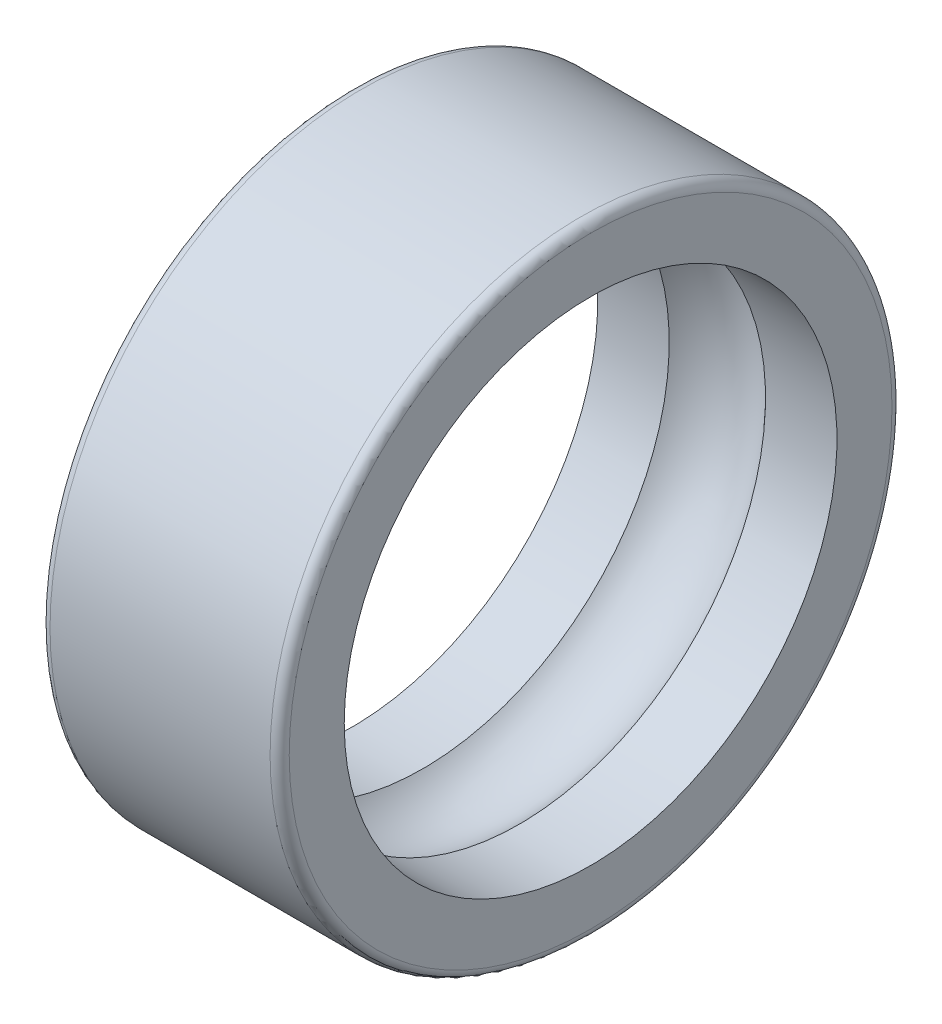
ISO-10303-21;
HEADER;
FILE_DESCRIPTION(('STEP AP214'),'2;1');
FILE_NAME('part.step','',(''),(''),'','','');
FILE_SCHEMA(('AUTOMOTIVE_DESIGN { 1 0 10303 214 1 1 1 1 }'));
ENDSEC;
DATA;
#1=APPLICATION_CONTEXT('core data for automotive mechanical design processes');
#2=APPLICATION_PROTOCOL_DEFINITION('international standard','automotive_design',2000,#1);
#3=PRODUCT_CONTEXT('',#1,'mechanical');
#4=PRODUCT('Part','Part','',(#3));
#5=PRODUCT_RELATED_PRODUCT_CATEGORY('part','',(#4));
#6=PRODUCT_DEFINITION_FORMATION('','',#4);
#7=PRODUCT_DEFINITION_CONTEXT('part definition',#1,'design');
#8=PRODUCT_DEFINITION('design','',#6,#7);
#9=PRODUCT_DEFINITION_SHAPE('','',#8);
#10=(LENGTH_UNIT() NAMED_UNIT(*) SI_UNIT(.MILLI.,.METRE.));
#11=(NAMED_UNIT(*) PLANE_ANGLE_UNIT() SI_UNIT($,.RADIAN.));
#12=(NAMED_UNIT(*) SI_UNIT($,.STERADIAN.) SOLID_ANGLE_UNIT());
#13=UNCERTAINTY_MEASURE_WITH_UNIT(LENGTH_MEASURE(1.E-05),#10,'distance_accuracy_value','');
#14=(GEOMETRIC_REPRESENTATION_CONTEXT(3) GLOBAL_UNCERTAINTY_ASSIGNED_CONTEXT((#13)) GLOBAL_UNIT_ASSIGNED_CONTEXT((#10,
#11,#12)) REPRESENTATION_CONTEXT('',''));
#15=CARTESIAN_POINT('',(0.,0.,0.));
#16=DIRECTION('',(0.,0.,1.));
#17=DIRECTION('',(1.,0.,0.));
#18=AXIS2_PLACEMENT_3D('',#15,#16,#17);
#19=CARTESIAN_POINT('',(0.200000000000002,0.,0.));
#20=DIRECTION('',(-0.999999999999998,0.,0.));
#21=DIRECTION('',(0.,0.,1.));
#22=AXIS2_PLACEMENT_3D('',#19,#20,#21);
#23=TOROIDAL_SURFACE('',#22,6.3,0.2);
#24=CARTESIAN_POINT('',(0.,0.,0.));
#25=DIRECTION('',(-0.999999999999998,0.,0.));
#26=DIRECTION('',(0.,0.,1.));
#27=AXIS2_PLACEMENT_3D('',#24,#25,#26);
#28=CIRCLE('',#27,6.3);
#29=CARTESIAN_POINT('',(0.,0.,6.30000000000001));
#30=VERTEX_POINT('',#29);
#31=EDGE_CURVE('E10',#30,#30,#28,.T.);
#32=ORIENTED_EDGE('',*,*,#31,.F.);
#33=EDGE_LOOP('',(#32));
#34=FACE_BOUND('',#33,.T.);
#35=CARTESIAN_POINT('',(0.200000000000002,0.,0.));
#36=DIRECTION('',(-0.999999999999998,0.,0.));
#37=DIRECTION('',(0.,0.,1.));
#38=AXIS2_PLACEMENT_3D('',#35,#36,#37);
#39=CIRCLE('',#38,6.5);
#40=CARTESIAN_POINT('',(0.200000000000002,0.,6.50000000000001));
#41=VERTEX_POINT('',#40);
#42=EDGE_CURVE('E52',#41,#41,#39,.T.);
#43=ORIENTED_EDGE('',*,*,#42,.T.);
#44=EDGE_LOOP('',(#43));
#45=FACE_BOUND('',#44,.T.);
#46=ADVANCED_FACE('F24',(#34,#45),#23,.T.);
#47=CARTESIAN_POINT('',(0.,0.,-6.30000000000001));
#48=DIRECTION('',(0.999999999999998,0.,0.));
#49=DIRECTION('',(0.,0.,-1.));
#50=AXIS2_PLACEMENT_3D('',#47,#48,#49);
#51=PLANE('',#50);
#52=CARTESIAN_POINT('',(0.,0.,0.));
#53=DIRECTION('',(-0.999999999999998,0.,0.));
#54=DIRECTION('',(0.,0.,1.));
#55=AXIS2_PLACEMENT_3D('',#52,#53,#54);
#56=CIRCLE('',#55,5.15);
#57=CARTESIAN_POINT('',(0.,0.,5.15000000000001));
#58=VERTEX_POINT('',#57);
#59=EDGE_CURVE('E30',#58,#58,#56,.T.);
#60=ORIENTED_EDGE('',*,*,#59,.F.);
#61=EDGE_LOOP('',(#60));
#62=FACE_BOUND('',#61,.T.);
#63=ORIENTED_EDGE('',*,*,#31,.T.);
#64=EDGE_LOOP('',(#63));
#65=FACE_BOUND('',#64,.T.);
#66=ADVANCED_FACE('F89',(#62,#65),#51,.F.);
#67=CARTESIAN_POINT('',(0.,0.,0.));
#68=DIRECTION('',(-0.999999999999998,0.,0.));
#69=DIRECTION('',(0.,0.,1.));
#70=AXIS2_PLACEMENT_3D('',#67,#68,#69);
#71=CYLINDRICAL_SURFACE('',#70,5.15);
#72=CARTESIAN_POINT('',(1.4937694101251,0.,0.));
#73=DIRECTION('',(-0.999999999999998,0.,0.));
#74=DIRECTION('',(0.,0.,1.));
#75=AXIS2_PLACEMENT_3D('',#72,#73,#74);
#76=CIRCLE('',#75,5.15);
#77=CARTESIAN_POINT('',(1.4937694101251,0.,5.15000000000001));
#78=VERTEX_POINT('',#77);
#79=EDGE_CURVE('E34',#78,#78,#76,.T.);
#80=CARTESIAN_POINT('',(1.4937694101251,0.,5.15000000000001));
#81=CARTESIAN_POINT('',(1.47820931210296,0.,5.15000000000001));
#82=CARTESIAN_POINT('',(1.46264921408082,0.,5.15000000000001));
#83=CARTESIAN_POINT('',(1.43152901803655,0.,5.15000000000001));
#84=CARTESIAN_POINT('',(1.41596892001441,0.,5.15000000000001));
#85=CARTESIAN_POINT('',(1.38484872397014,0.,5.15000000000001));
#86=CARTESIAN_POINT('',(1.36928862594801,0.,5.15000000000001));
#87=CARTESIAN_POINT('',(1.33816842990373,0.,5.15000000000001));
#88=CARTESIAN_POINT('',(1.3226083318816,0.,5.15000000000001));
#89=CARTESIAN_POINT('',(1.29148813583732,0.,5.15000000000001));
#90=CARTESIAN_POINT('',(1.27592803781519,0.,5.15000000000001));
#91=CARTESIAN_POINT('',(1.24480784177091,0.,5.15000000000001));
#92=CARTESIAN_POINT('',(1.22924774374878,0.,5.15000000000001));
#93=CARTESIAN_POINT('',(1.19812754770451,0.,5.15000000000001));
#94=CARTESIAN_POINT('',(1.18256744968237,0.,5.15000000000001));
#95=CARTESIAN_POINT('',(1.1514472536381,0.,5.15000000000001));
#96=CARTESIAN_POINT('',(1.13588715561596,0.,5.15000000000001));
#97=CARTESIAN_POINT('',(1.10476695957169,0.,5.15000000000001));
#98=CARTESIAN_POINT('',(1.08920686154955,0.,5.15000000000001));
#99=CARTESIAN_POINT('',(1.05808666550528,0.,5.15000000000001));
#100=CARTESIAN_POINT('',(1.04252656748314,0.,5.15000000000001));
#101=CARTESIAN_POINT('',(1.01140637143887,0.,5.15000000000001));
#102=CARTESIAN_POINT('',(0.995846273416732,0.,5.15000000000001));
#103=CARTESIAN_POINT('',(0.964726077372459,0.,5.15000000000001));
#104=CARTESIAN_POINT('',(0.949165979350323,0.,5.15000000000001));
#105=CARTESIAN_POINT('',(0.91804578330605,0.,5.15000000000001));
#106=CARTESIAN_POINT('',(0.902485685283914,0.,5.15000000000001));
#107=CARTESIAN_POINT('',(0.871365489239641,0.,5.15000000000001));
#108=CARTESIAN_POINT('',(0.855805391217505,0.,5.15000000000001));
#109=CARTESIAN_POINT('',(0.824685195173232,0.,5.15000000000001));
#110=CARTESIAN_POINT('',(0.809125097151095,0.,5.15000000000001));
#111=CARTESIAN_POINT('',(0.778004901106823,0.,5.15000000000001));
#112=CARTESIAN_POINT('',(0.762444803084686,0.,5.15000000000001));
#113=CARTESIAN_POINT('',(0.731324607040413,0.,5.15000000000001));
#114=CARTESIAN_POINT('',(0.715764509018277,0.,5.15000000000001));
#115=CARTESIAN_POINT('',(0.684644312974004,0.,5.15000000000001));
#116=CARTESIAN_POINT('',(0.669084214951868,0.,5.15000000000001));
#117=CARTESIAN_POINT('',(0.637964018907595,0.,5.15000000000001));
#118=CARTESIAN_POINT('',(0.622403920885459,0.,5.15000000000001));
#119=CARTESIAN_POINT('',(0.591283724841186,0.,5.15000000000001));
#120=CARTESIAN_POINT('',(0.57572362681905,0.,5.15000000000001));
#121=CARTESIAN_POINT('',(0.544603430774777,0.,5.15000000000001));
#122=CARTESIAN_POINT('',(0.52904333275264,0.,5.15000000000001));
#123=CARTESIAN_POINT('',(0.497923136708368,0.,5.15000000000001));
#124=CARTESIAN_POINT('',(0.482363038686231,0.,5.15000000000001));
#125=CARTESIAN_POINT('',(0.451242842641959,0.,5.15000000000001));
#126=CARTESIAN_POINT('',(0.435682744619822,0.,5.15000000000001));
#127=CARTESIAN_POINT('',(0.404562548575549,0.,5.15000000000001));
#128=CARTESIAN_POINT('',(0.389002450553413,0.,5.15000000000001));
#129=CARTESIAN_POINT('',(0.35788225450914,0.,5.15000000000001));
#130=CARTESIAN_POINT('',(0.342322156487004,0.,5.15000000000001));
#131=CARTESIAN_POINT('',(0.311201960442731,0.,5.15000000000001));
#132=CARTESIAN_POINT('',(0.295641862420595,0.,5.15000000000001));
#133=CARTESIAN_POINT('',(0.264521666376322,0.,5.15000000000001));
#134=CARTESIAN_POINT('',(0.248961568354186,0.,5.15000000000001));
#135=CARTESIAN_POINT('',(0.217841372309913,0.,5.15000000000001));
#136=CARTESIAN_POINT('',(0.202281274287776,0.,5.15000000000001));
#137=CARTESIAN_POINT('',(0.171161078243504,0.,5.15000000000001));
#138=CARTESIAN_POINT('',(0.155600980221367,0.,5.15000000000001));
#139=CARTESIAN_POINT('',(0.124480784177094,0.,5.15000000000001));
#140=CARTESIAN_POINT('',(0.108920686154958,0.,5.15000000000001));
#141=CARTESIAN_POINT('',(0.0778004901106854,0.,5.15000000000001));
#142=CARTESIAN_POINT('',(0.0622403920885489,0.,5.15000000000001));
#143=CARTESIAN_POINT('',(0.0311201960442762,0.,5.15000000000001));
#144=CARTESIAN_POINT('',(0.0155600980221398,0.,5.15000000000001));
#145=CARTESIAN_POINT('',(0.,0.,5.15000000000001));
#146=B_SPLINE_CURVE_WITH_KNOTS('',3,(#80,#81,#82,#83,#84,#85,#86,#87,#88,#89,#90,#91,#92,#93,
#94,#95,#96,#97,#98,#99,#100,#101,#102,#103,#104,#105,#106,#107,#108,#109,#110,#111,#112,#113,
#114,#115,#116,#117,#118,#119,#120,#121,#122,#123,#124,#125,#126,#127,#128,#129,#130,#131,#132,
#133,#134,#135,#136,#137,#138,#139,#140,#141,#142,#143,#144,#145),.UNSPECIFIED.,.F.,.F.,(4,2,2,
2,2,2,2,2,2,2,2,2,2,2,2,2,2,2,2,2,2,2,2,2,2,2,2,2,2,2,2,2,4),(0.,0.0466802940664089,
0.0933605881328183,0.140040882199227,0.186721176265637,0.233401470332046,0.280081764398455,
0.326762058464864,0.373442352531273,0.420122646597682,0.466802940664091,0.513483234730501,
0.56016352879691,0.606843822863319,0.653524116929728,0.700204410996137,0.746884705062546,
0.793564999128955,0.840245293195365,0.886925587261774,0.933605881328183,0.980286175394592,
1.026966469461,1.07364676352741,1.12032705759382,1.16700735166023,1.21368764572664,
1.26036793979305,1.30704823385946,1.35372852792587,1.40040882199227,1.44708911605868,
1.49376941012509),.UNSPECIFIED.);
#147=EDGE_CURVE('BSEAM84',#78,#58,#146,.T.);
#148=ORIENTED_EDGE('',*,*,#79,.F.);
#149=ORIENTED_EDGE('',*,*,#59,.T.);
#150=ORIENTED_EDGE('',*,*,#147,.T.);
#151=ORIENTED_EDGE('',*,*,#147,.F.);
#152=EDGE_LOOP('',(#148,#150,#149,#151));
#153=FACE_BOUND('',#152,.T.);
#154=ADVANCED_FACE('F84',(#153),#71,.F.);
#155=CARTESIAN_POINT('',(2.5,0.,0.));
#156=DIRECTION('',(-0.999999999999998,0.,0.));
#157=DIRECTION('',(0.,0.,1.));
#158=AXIS2_PLACEMENT_3D('',#155,#156,#157);
#159=TOROIDAL_SURFACE('',#158,4.25,1.35);
#160=CARTESIAN_POINT('',(3.50623058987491,0.,0.));
#161=DIRECTION('',(-0.999999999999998,0.,0.));
#162=DIRECTION('',(0.,0.,1.));
#163=AXIS2_PLACEMENT_3D('',#160,#161,#162);
#164=CIRCLE('',#163,5.15);
#165=CARTESIAN_POINT('',(3.50623058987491,0.,5.15000000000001));
#166=VERTEX_POINT('',#165);
#167=EDGE_CURVE('E38',#166,#166,#164,.T.);
#168=ORIENTED_EDGE('',*,*,#167,.F.);
#169=EDGE_LOOP('',(#168));
#170=FACE_BOUND('',#169,.T.);
#171=ORIENTED_EDGE('',*,*,#79,.T.);
#172=EDGE_LOOP('',(#171));
#173=FACE_BOUND('',#172,.T.);
#174=ADVANCED_FACE('F78',(#170,#173),#159,.F.);
#175=CARTESIAN_POINT('',(0.,0.,0.));
#176=DIRECTION('',(-0.999999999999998,0.,0.));
#177=DIRECTION('',(0.,0.,1.));
#178=AXIS2_PLACEMENT_3D('',#175,#176,#177);
#179=CYLINDRICAL_SURFACE('',#178,5.15);
#180=CARTESIAN_POINT('',(5.,0.,0.));
#181=DIRECTION('',(-0.999999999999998,0.,0.));
#182=DIRECTION('',(0.,0.,1.));
#183=AXIS2_PLACEMENT_3D('',#180,#181,#182);
#184=CIRCLE('',#183,5.15);
#185=CARTESIAN_POINT('',(5.,0.,5.15000000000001));
#186=VERTEX_POINT('',#185);
#187=EDGE_CURVE('E43',#186,#186,#184,.T.);
#188=CARTESIAN_POINT('',(5.,0.,5.15000000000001));
#189=CARTESIAN_POINT('',(4.98443990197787,0.,5.15000000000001));
#190=CARTESIAN_POINT('',(4.96887980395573,0.,5.15000000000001));
#191=CARTESIAN_POINT('',(4.93775960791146,0.,5.15000000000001));
#192=CARTESIAN_POINT('',(4.92219950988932,0.,5.15000000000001));
#193=CARTESIAN_POINT('',(4.89107931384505,0.,5.15000000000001));
#194=CARTESIAN_POINT('',(4.87551921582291,0.,5.15000000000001));
#195=CARTESIAN_POINT('',(4.84439901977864,0.,5.15000000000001));
#196=CARTESIAN_POINT('',(4.82883892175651,0.,5.15000000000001));
#197=CARTESIAN_POINT('',(4.79771872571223,0.,5.15000000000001));
#198=CARTESIAN_POINT('',(4.7821586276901,0.,5.15000000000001));
#199=CARTESIAN_POINT('',(4.75103843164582,0.,5.15000000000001));
#200=CARTESIAN_POINT('',(4.73547833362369,0.,5.15000000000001));
#201=CARTESIAN_POINT('',(4.70435813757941,0.,5.15000000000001));
#202=CARTESIAN_POINT('',(4.68879803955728,0.,5.15000000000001));
#203=CARTESIAN_POINT('',(4.657677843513,0.,5.15000000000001));
#204=CARTESIAN_POINT('',(4.64211774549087,0.,5.15000000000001));
#205=CARTESIAN_POINT('',(4.61099754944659,0.,5.15000000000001));
#206=CARTESIAN_POINT('',(4.59543745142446,0.,5.15000000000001));
#207=CARTESIAN_POINT('',(4.56431725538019,0.,5.15000000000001));
#208=CARTESIAN_POINT('',(4.54875715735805,0.,5.15000000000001));
#209=CARTESIAN_POINT('',(4.51763696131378,0.,5.15000000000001));
#210=CARTESIAN_POINT('',(4.50207686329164,0.,5.15000000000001));
#211=CARTESIAN_POINT('',(4.47095666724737,0.,5.15000000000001));
#212=CARTESIAN_POINT('',(4.45539656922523,0.,5.15000000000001));
#213=CARTESIAN_POINT('',(4.42427637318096,0.,5.15000000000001));
#214=CARTESIAN_POINT('',(4.40871627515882,0.,5.15000000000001));
#215=CARTESIAN_POINT('',(4.37759607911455,0.,5.15000000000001));
#216=CARTESIAN_POINT('',(4.36203598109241,0.,5.15000000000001));
#217=CARTESIAN_POINT('',(4.33091578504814,0.,5.15000000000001));
#218=CARTESIAN_POINT('',(4.315355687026,0.,5.15000000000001));
#219=CARTESIAN_POINT('',(4.28423549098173,0.,5.15000000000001));
#220=CARTESIAN_POINT('',(4.26867539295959,0.,5.15000000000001));
#221=CARTESIAN_POINT('',(4.23755519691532,0.,5.15000000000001));
#222=CARTESIAN_POINT('',(4.22199509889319,0.,5.15000000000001));
#223=CARTESIAN_POINT('',(4.19087490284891,0.,5.15000000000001));
#224=CARTESIAN_POINT('',(4.17531480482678,0.,5.15000000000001));
#225=CARTESIAN_POINT('',(4.1441946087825,0.,5.15000000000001));
#226=CARTESIAN_POINT('',(4.12863451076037,0.,5.15000000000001));
#227=CARTESIAN_POINT('',(4.0975143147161,0.,5.15000000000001));
#228=CARTESIAN_POINT('',(4.08195421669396,0.,5.15000000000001));
#229=CARTESIAN_POINT('',(4.05083402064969,0.,5.15000000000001));
#230=CARTESIAN_POINT('',(4.03527392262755,0.,5.15000000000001));
#231=CARTESIAN_POINT('',(4.00415372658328,0.,5.15000000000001));
#232=CARTESIAN_POINT('',(3.98859362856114,0.,5.15000000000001));
#233=CARTESIAN_POINT('',(3.95747343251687,0.,5.15000000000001));
#234=CARTESIAN_POINT('',(3.94191333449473,0.,5.15000000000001));
#235=CARTESIAN_POINT('',(3.91079313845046,0.,5.15000000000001));
#236=CARTESIAN_POINT('',(3.89523304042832,0.,5.15000000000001));
#237=CARTESIAN_POINT('',(3.86411284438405,0.,5.15000000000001));
#238=CARTESIAN_POINT('',(3.84855274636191,0.,5.15000000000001));
#239=CARTESIAN_POINT('',(3.81743255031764,0.,5.15000000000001));
#240=CARTESIAN_POINT('',(3.8018724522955,0.,5.15000000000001));
#241=CARTESIAN_POINT('',(3.77075225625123,0.,5.15000000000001));
#242=CARTESIAN_POINT('',(3.75519215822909,0.,5.15000000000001));
#243=CARTESIAN_POINT('',(3.72407196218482,0.,5.15000000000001));
#244=CARTESIAN_POINT('',(3.70851186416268,0.,5.15000000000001));
#245=CARTESIAN_POINT('',(3.67739166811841,0.,5.15000000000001));
#246=CARTESIAN_POINT('',(3.66183157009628,0.,5.15000000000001));
#247=CARTESIAN_POINT('',(3.630711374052,0.,5.15000000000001));
#248=CARTESIAN_POINT('',(3.61515127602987,0.,5.15000000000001));
#249=CARTESIAN_POINT('',(3.58403107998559,0.,5.15000000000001));
#250=CARTESIAN_POINT('',(3.56847098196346,0.,5.15000000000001));
#251=CARTESIAN_POINT('',(3.53735078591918,0.,5.15000000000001));
#252=CARTESIAN_POINT('',(3.52179068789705,0.,5.15000000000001));
#253=CARTESIAN_POINT('',(3.50623058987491,0.,5.15000000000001));
#254=B_SPLINE_CURVE_WITH_KNOTS('',3,(#188,#189,#190,#191,#192,#193,#194,#195,#196,#197,#198,
#199,#200,#201,#202,#203,#204,#205,#206,#207,#208,#209,#210,#211,#212,#213,#214,#215,#216,#217,
#218,#219,#220,#221,#222,#223,#224,#225,#226,#227,#228,#229,#230,#231,#232,#233,#234,#235,#236,
#237,#238,#239,#240,#241,#242,#243,#244,#245,#246,#247,#248,#249,#250,#251,#252,#253),
.UNSPECIFIED.,.F.,.F.,(4,2,2,2,2,2,2,2,2,2,2,2,2,2,2,2,2,2,2,2,2,2,2,2,2,2,2,2,2,2,2,2,4),(0.,
0.0466802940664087,0.0933605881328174,0.140040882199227,0.186721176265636,0.233401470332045,
0.280081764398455,0.326762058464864,0.373442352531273,0.420122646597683,0.466802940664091,
0.5134832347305,0.56016352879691,0.606843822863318,0.653524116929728,0.700204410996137,
0.746884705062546,0.793564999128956,0.840245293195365,0.886925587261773,0.933605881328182,
0.980286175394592,1.026966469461,1.07364676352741,1.12032705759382,1.16700735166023,
1.21368764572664,1.26036793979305,1.30704823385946,1.35372852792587,1.40040882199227,
1.44708911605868,1.49376941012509),.UNSPECIFIED.);
#255=EDGE_CURVE('BSEAM72',#186,#166,#254,.T.);
#256=ORIENTED_EDGE('',*,*,#187,.F.);
#257=ORIENTED_EDGE('',*,*,#167,.T.);
#258=ORIENTED_EDGE('',*,*,#255,.T.);
#259=ORIENTED_EDGE('',*,*,#255,.F.);
#260=EDGE_LOOP('',(#256,#258,#257,#259));
#261=FACE_BOUND('',#260,.T.);
#262=ADVANCED_FACE('F72',(#261),#179,.F.);
#263=CARTESIAN_POINT('',(5.,0.,-6.30000000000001));
#264=DIRECTION('',(-0.999999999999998,0.,0.));
#265=DIRECTION('',(0.,0.,1.));
#266=AXIS2_PLACEMENT_3D('',#263,#264,#265);
#267=PLANE('',#266);
#268=CARTESIAN_POINT('',(5.,0.,0.));
#269=DIRECTION('',(-0.999999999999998,0.,0.));
#270=DIRECTION('',(0.,0.,1.));
#271=AXIS2_PLACEMENT_3D('',#268,#269,#270);
#272=CIRCLE('',#271,6.3);
#273=CARTESIAN_POINT('',(5.,0.,6.30000000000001));
#274=VERTEX_POINT('',#273);
#275=EDGE_CURVE('E46',#274,#274,#272,.T.);
#276=ORIENTED_EDGE('',*,*,#275,.F.);
#277=EDGE_LOOP('',(#276));
#278=FACE_BOUND('',#277,.T.);
#279=ORIENTED_EDGE('',*,*,#187,.T.);
#280=EDGE_LOOP('',(#279));
#281=FACE_BOUND('',#280,.T.);
#282=ADVANCED_FACE('F66',(#278,#281),#267,.F.);
#283=CARTESIAN_POINT('',(4.8,0.,0.));
#284=DIRECTION('',(-0.999999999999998,0.,0.));
#285=DIRECTION('',(0.,0.,1.));
#286=AXIS2_PLACEMENT_3D('',#283,#284,#285);
#287=TOROIDAL_SURFACE('',#286,6.3,0.200000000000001);
#288=CARTESIAN_POINT('',(4.8,0.,0.));
#289=DIRECTION('',(-0.999999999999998,0.,0.));
#290=DIRECTION('',(0.,0.,1.));
#291=AXIS2_PLACEMENT_3D('',#288,#289,#290);
#292=CIRCLE('',#291,6.5);
#293=CARTESIAN_POINT('',(4.8,0.,6.50000000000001));
#294=VERTEX_POINT('',#293);
#295=EDGE_CURVE('E49',#294,#294,#292,.T.);
#296=ORIENTED_EDGE('',*,*,#295,.F.);
#297=EDGE_LOOP('',(#296));
#298=FACE_BOUND('',#297,.T.);
#299=ORIENTED_EDGE('',*,*,#275,.T.);
#300=EDGE_LOOP('',(#299));
#301=FACE_BOUND('',#300,.T.);
#302=ADVANCED_FACE('F60',(#298,#301),#287,.T.);
#303=CARTESIAN_POINT('',(0.,0.,0.));
#304=DIRECTION('',(-0.999999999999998,0.,0.));
#305=DIRECTION('',(0.,0.,1.));
#306=AXIS2_PLACEMENT_3D('',#303,#304,#305);
#307=CYLINDRICAL_SURFACE('',#306,6.5);
#308=CARTESIAN_POINT('',(0.200000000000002,0.,6.50000000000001));
#309=CARTESIAN_POINT('',(0.247916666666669,0.,6.50000000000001));
#310=CARTESIAN_POINT('',(0.295833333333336,0.,6.50000000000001));
#311=CARTESIAN_POINT('',(0.391666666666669,0.,6.50000000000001));
#312=CARTESIAN_POINT('',(0.439583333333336,0.,6.50000000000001));
#313=CARTESIAN_POINT('',(0.535416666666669,0.,6.50000000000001));
#314=CARTESIAN_POINT('',(0.583333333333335,0.,6.50000000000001));
#315=CARTESIAN_POINT('',(0.679166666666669,0.,6.50000000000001));
#316=CARTESIAN_POINT('',(0.727083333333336,0.,6.50000000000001));
#317=CARTESIAN_POINT('',(0.822916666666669,0.,6.50000000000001));
#318=CARTESIAN_POINT('',(0.870833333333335,0.,6.50000000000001));
#319=CARTESIAN_POINT('',(0.966666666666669,0.,6.50000000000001));
#320=CARTESIAN_POINT('',(1.01458333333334,0.,6.50000000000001));
#321=CARTESIAN_POINT('',(1.11041666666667,0.,6.50000000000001));
#322=CARTESIAN_POINT('',(1.15833333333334,0.,6.50000000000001));
#323=CARTESIAN_POINT('',(1.25416666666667,0.,6.50000000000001));
#324=CARTESIAN_POINT('',(1.30208333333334,0.,6.50000000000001));
#325=CARTESIAN_POINT('',(1.39791666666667,0.,6.50000000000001));
#326=CARTESIAN_POINT('',(1.44583333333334,0.,6.50000000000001));
#327=CARTESIAN_POINT('',(1.54166666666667,0.,6.50000000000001));
#328=CARTESIAN_POINT('',(1.58958333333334,0.,6.50000000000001));
#329=CARTESIAN_POINT('',(1.68541666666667,0.,6.50000000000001));
#330=CARTESIAN_POINT('',(1.73333333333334,0.,6.50000000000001));
#331=CARTESIAN_POINT('',(1.82916666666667,0.,6.50000000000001));
#332=CARTESIAN_POINT('',(1.87708333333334,0.,6.50000000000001));
#333=CARTESIAN_POINT('',(1.97291666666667,0.,6.50000000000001));
#334=CARTESIAN_POINT('',(2.02083333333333,0.,6.50000000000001));
#335=CARTESIAN_POINT('',(2.11666666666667,0.,6.50000000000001));
#336=CARTESIAN_POINT('',(2.16458333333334,0.,6.50000000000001));
#337=CARTESIAN_POINT('',(2.26041666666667,0.,6.50000000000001));
#338=CARTESIAN_POINT('',(2.30833333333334,0.,6.50000000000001));
#339=CARTESIAN_POINT('',(2.40416666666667,0.,6.50000000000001));
#340=CARTESIAN_POINT('',(2.45208333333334,0.,6.50000000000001));
#341=CARTESIAN_POINT('',(2.54791666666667,0.,6.50000000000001));
#342=CARTESIAN_POINT('',(2.59583333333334,0.,6.50000000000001));
#343=CARTESIAN_POINT('',(2.69166666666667,0.,6.50000000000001));
#344=CARTESIAN_POINT('',(2.73958333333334,0.,6.50000000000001));
#345=CARTESIAN_POINT('',(2.83541666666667,0.,6.50000000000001));
#346=CARTESIAN_POINT('',(2.88333333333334,0.,6.50000000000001));
#347=CARTESIAN_POINT('',(2.97916666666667,0.,6.50000000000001));
#348=CARTESIAN_POINT('',(3.02708333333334,0.,6.50000000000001));
#349=CARTESIAN_POINT('',(3.12291666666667,0.,6.50000000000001));
#350=CARTESIAN_POINT('',(3.17083333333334,0.,6.50000000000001));
#351=CARTESIAN_POINT('',(3.26666666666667,0.,6.50000000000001));
#352=CARTESIAN_POINT('',(3.31458333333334,0.,6.50000000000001));
#353=CARTESIAN_POINT('',(3.41041666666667,0.,6.50000000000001));
#354=CARTESIAN_POINT('',(3.45833333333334,0.,6.50000000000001));
#355=CARTESIAN_POINT('',(3.55416666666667,0.,6.50000000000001));
#356=CARTESIAN_POINT('',(3.60208333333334,0.,6.50000000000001));
#357=CARTESIAN_POINT('',(3.69791666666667,0.,6.50000000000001));
#358=CARTESIAN_POINT('',(3.74583333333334,0.,6.50000000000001));
#359=CARTESIAN_POINT('',(3.84166666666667,0.,6.50000000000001));
#360=CARTESIAN_POINT('',(3.88958333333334,0.,6.50000000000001));
#361=CARTESIAN_POINT('',(3.98541666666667,0.,6.50000000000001));
#362=CARTESIAN_POINT('',(4.03333333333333,0.,6.50000000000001));
#363=CARTESIAN_POINT('',(4.12916666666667,0.,6.50000000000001));
#364=CARTESIAN_POINT('',(4.17708333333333,0.,6.50000000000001));
#365=CARTESIAN_POINT('',(4.27291666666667,0.,6.50000000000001));
#366=CARTESIAN_POINT('',(4.32083333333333,0.,6.50000000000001));
#367=CARTESIAN_POINT('',(4.41666666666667,0.,6.50000000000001));
#368=CARTESIAN_POINT('',(4.46458333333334,0.,6.50000000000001));
#369=CARTESIAN_POINT('',(4.56041666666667,0.,6.50000000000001));
#370=CARTESIAN_POINT('',(4.60833333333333,0.,6.50000000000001));
#371=CARTESIAN_POINT('',(4.70416666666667,0.,6.50000000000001));
#372=CARTESIAN_POINT('',(4.75208333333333,0.,6.50000000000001));
#373=CARTESIAN_POINT('',(4.8,0.,6.50000000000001));
#374=B_SPLINE_CURVE_WITH_KNOTS('',3,(#308,#309,#310,#311,#312,#313,#314,#315,#316,#317,#318,
#319,#320,#321,#322,#323,#324,#325,#326,#327,#328,#329,#330,#331,#332,#333,#334,#335,#336,#337,
#338,#339,#340,#341,#342,#343,#344,#345,#346,#347,#348,#349,#350,#351,#352,#353,#354,#355,#356,
#357,#358,#359,#360,#361,#362,#363,#364,#365,#366,#367,#368,#369,#370,#371,#372,#373),
.UNSPECIFIED.,.F.,.F.,(4,2,2,2,2,2,2,2,2,2,2,2,2,2,2,2,2,2,2,2,2,2,2,2,2,2,2,2,2,2,2,2,4),(0.,
0.14375,0.2875,0.43125,0.575,0.71875,0.8625,1.00625,1.15,1.29375,1.4375,1.58125,1.725,1.86875,
2.0125,2.15625,2.3,2.44375,2.5875,2.73125,2.875,3.01875,3.1625,3.30625,3.45,3.59375,3.7375,
3.88125,4.025,4.16875,4.3125,4.45625,4.6),.UNSPECIFIED.);
#375=EDGE_CURVE('BSEAM57',#41,#294,#374,.T.);
#376=ORIENTED_EDGE('',*,*,#42,.F.);
#377=ORIENTED_EDGE('',*,*,#295,.T.);
#378=ORIENTED_EDGE('',*,*,#375,.T.);
#379=ORIENTED_EDGE('',*,*,#375,.F.);
#380=EDGE_LOOP('',(#376,#378,#377,#379));
#381=FACE_BOUND('',#380,.T.);
#382=ADVANCED_FACE('F57',(#381),#307,.T.);
#383=CLOSED_SHELL('',(#46,#66,#154,#174,#262,#282,#302,#382));
#384=MANIFOLD_SOLID_BREP('B2',#383);
#385=ADVANCED_BREP_SHAPE_REPRESENTATION('',(#18,#384),#14);
#386=SHAPE_DEFINITION_REPRESENTATION(#9,#385);
ENDSEC;
END-ISO-10303-21;
